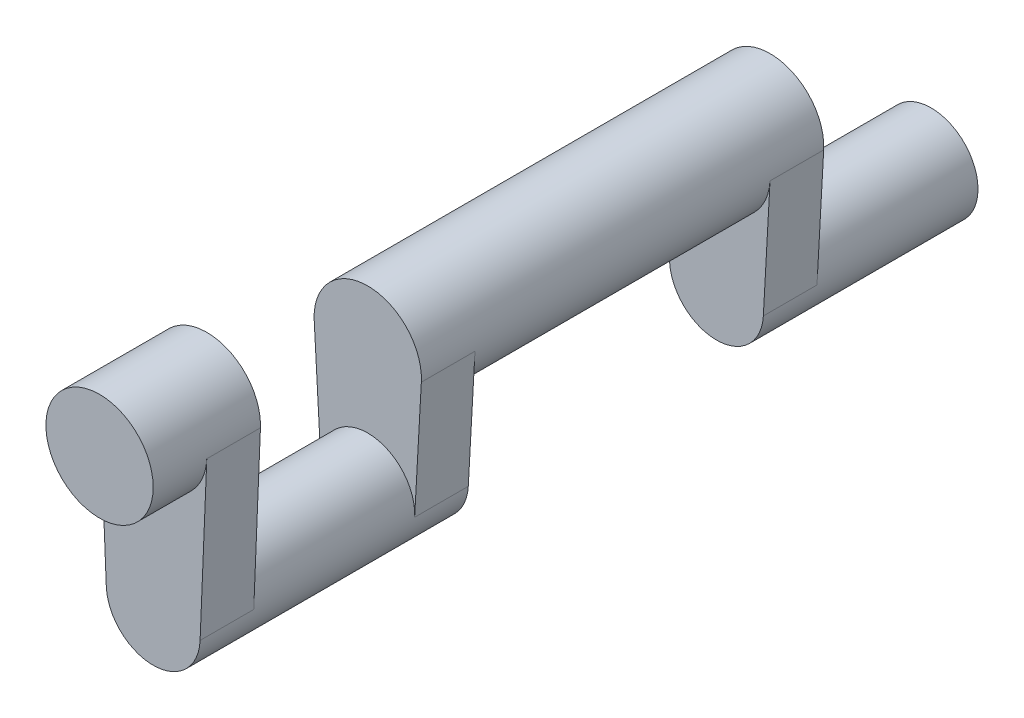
ISO-10303-21;
HEADER;
FILE_DESCRIPTION(('STEP AP214'),'2;1');
FILE_NAME('part.step','',(''),(''),'','','');
FILE_SCHEMA(('AUTOMOTIVE_DESIGN { 1 0 10303 214 1 1 1 1 }'));
ENDSEC;
DATA;
#1=APPLICATION_CONTEXT('core data for automotive mechanical design processes');
#2=APPLICATION_PROTOCOL_DEFINITION('international standard','automotive_design',2000,#1);
#3=PRODUCT_CONTEXT('',#1,'mechanical');
#4=PRODUCT('Part','Part','',(#3));
#5=PRODUCT_RELATED_PRODUCT_CATEGORY('part','',(#4));
#6=PRODUCT_DEFINITION_FORMATION('','',#4);
#7=PRODUCT_DEFINITION_CONTEXT('part definition',#1,'design');
#8=PRODUCT_DEFINITION('design','',#6,#7);
#9=PRODUCT_DEFINITION_SHAPE('','',#8);
#10=(LENGTH_UNIT() NAMED_UNIT(*) SI_UNIT(.MILLI.,.METRE.));
#11=(NAMED_UNIT(*) PLANE_ANGLE_UNIT() SI_UNIT($,.RADIAN.));
#12=(NAMED_UNIT(*) SI_UNIT($,.STERADIAN.) SOLID_ANGLE_UNIT());
#13=UNCERTAINTY_MEASURE_WITH_UNIT(LENGTH_MEASURE(1.E-05),#10,'distance_accuracy_value','');
#14=(GEOMETRIC_REPRESENTATION_CONTEXT(3) GLOBAL_UNCERTAINTY_ASSIGNED_CONTEXT((#13)) GLOBAL_UNIT_ASSIGNED_CONTEXT((#10,
#11,#12)) REPRESENTATION_CONTEXT('',''));
#15=CARTESIAN_POINT('',(0.,0.,0.));
#16=DIRECTION('',(0.,0.,1.));
#17=DIRECTION('',(1.,0.,0.));
#18=AXIS2_PLACEMENT_3D('',#15,#16,#17);
#19=CARTESIAN_POINT('',(0.,-19.0500000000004,-317.5));
#20=DIRECTION('',(0.,0.,-1.));
#21=DIRECTION('',(-1.,0.,0.));
#22=AXIS2_PLACEMENT_3D('',#19,#20,#21);
#23=PLANE('',#22);
#24=DIRECTION('',(-0.0555555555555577,-0.998455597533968,0.));
#25=VECTOR('',#24,1.);
#26=CARTESIAN_POINT('',(22.1906756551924,-77.4347222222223,-317.5));
#27=LINE('',#26,#25);
#28=CARTESIAN_POINT('',(25.3607721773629,-20.4611111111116,-317.5));
#29=VERTEX_POINT('',#28);
#30=CARTESIAN_POINT('',(22.1906756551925,-77.4347222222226,-317.5));
#31=VERTEX_POINT('',#30);
#32=EDGE_CURVE('E137',#29,#31,#27,.T.);
#33=ORIENTED_EDGE('',*,*,#32,.T.);
#34=CARTESIAN_POINT('',(0.,-76.2000000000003,-317.5));
#35=DIRECTION('',(0.,0.,1.));
#36=DIRECTION('',(1.,0.,0.));
#37=AXIS2_PLACEMENT_3D('',#34,#35,#36);
#38=CIRCLE('',#37,22.225);
#39=CARTESIAN_POINT('',(-22.1906756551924,-77.4347222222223,-317.5));
#40=VERTEX_POINT('',#39);
#41=EDGE_CURVE('E11',#31,#40,#38,.T.);
#42=ORIENTED_EDGE('',*,*,#41,.T.);
#43=DIRECTION('',(-0.0555555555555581,0.998455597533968,0.));
#44=VECTOR('',#43,1.);
#45=CARTESIAN_POINT('',(-25.3607721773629,-20.4611111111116,-317.5));
#46=LINE('',#45,#44);
#47=CARTESIAN_POINT('',(-25.3607721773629,-20.4611111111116,-317.5));
#48=VERTEX_POINT('',#47);
#49=EDGE_CURVE('E51',#40,#48,#46,.T.);
#50=ORIENTED_EDGE('',*,*,#49,.T.);
#51=CARTESIAN_POINT('',(0.,-19.0500000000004,-317.5));
#52=DIRECTION('',(0.,0.,-1.));
#53=DIRECTION('',(-1.,0.,0.));
#54=AXIS2_PLACEMENT_3D('',#51,#52,#53);
#55=CIRCLE('',#54,25.4000000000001);
#56=EDGE_CURVE('E144',#48,#29,#55,.T.);
#57=ORIENTED_EDGE('',*,*,#56,.T.);
#58=EDGE_LOOP('',(#33,#42,#50,#57));
#59=FACE_BOUND('',#58,.T.);
#60=ADVANCED_FACE('F35',(#59),#23,.T.);
#61=CARTESIAN_POINT('',(0.,-76.2,-152.4));
#62=DIRECTION('',(0.,0.,-1.));
#63=DIRECTION('',(-1.,0.,0.));
#64=AXIS2_PLACEMENT_3D('',#61,#62,#63);
#65=PLANE('',#64);
#66=DIRECTION('',(-0.0555555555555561,0.998455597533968,0.));
#67=VECTOR('',#66,1.);
#68=CARTESIAN_POINT('',(-25.3607721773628,-20.4611111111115,-152.4));
#69=LINE('',#68,#67);
#70=CARTESIAN_POINT('',(-22.1906756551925,-77.4347222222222,-152.4));
#71=VERTEX_POINT('',#70);
#72=CARTESIAN_POINT('',(-25.3607721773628,-20.4611111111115,-152.4));
#73=VERTEX_POINT('',#72);
#74=EDGE_CURVE('E316',#71,#73,#69,.T.);
#75=ORIENTED_EDGE('',*,*,#74,.T.);
#76=CARTESIAN_POINT('',(0.,-19.0500000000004,-152.4));
#77=DIRECTION('',(0.,0.,-1.));
#78=DIRECTION('',(-1.,0.,0.));
#79=AXIS2_PLACEMENT_3D('',#76,#77,#78);
#80=CIRCLE('',#79,25.4000000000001);
#81=CARTESIAN_POINT('',(25.3607721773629,-20.4611111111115,-152.4));
#82=VERTEX_POINT('',#81);
#83=EDGE_CURVE('E161',#73,#82,#80,.F.);
#84=ORIENTED_EDGE('',*,*,#83,.T.);
#85=DIRECTION('',(-0.0555555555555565,-0.998455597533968,0.));
#86=VECTOR('',#85,1.);
#87=CARTESIAN_POINT('',(22.1906756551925,-77.4347222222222,-152.4));
#88=LINE('',#87,#86);
#89=CARTESIAN_POINT('',(22.1906756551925,-77.4347222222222,-152.4));
#90=VERTEX_POINT('',#89);
#91=EDGE_CURVE('E181',#82,#90,#88,.T.);
#92=ORIENTED_EDGE('',*,*,#91,.T.);
#93=CARTESIAN_POINT('',(0.,-76.2,-152.4));
#94=DIRECTION('',(0.,0.,-1.));
#95=DIRECTION('',(-1.,0.,0.));
#96=AXIS2_PLACEMENT_3D('',#93,#94,#95);
#97=CIRCLE('',#96,22.225);
#98=EDGE_CURVE('E187',#90,#71,#97,.T.);
#99=ORIENTED_EDGE('',*,*,#98,.T.);
#100=EDGE_LOOP('',(#75,#84,#92,#99));
#101=FACE_BOUND('',#100,.T.);
#102=ADVANCED_FACE('F277',(#101),#65,.T.);
#103=CARTESIAN_POINT('',(0.,0.,-25.4));
#104=DIRECTION('',(0.,0.,1.));
#105=DIRECTION('',(1.,0.,0.));
#106=AXIS2_PLACEMENT_3D('',#103,#104,#105);
#107=CYLINDRICAL_SURFACE('',#106,25.4);
#108=CARTESIAN_POINT('',(0.,0.,-25.4));
#109=DIRECTION('',(0.,0.,1.));
#110=DIRECTION('',(1.,0.,0.));
#111=AXIS2_PLACEMENT_3D('',#108,#109,#110);
#112=CIRCLE('',#111,25.4);
#113=CARTESIAN_POINT('',(-25.3779418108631,-1.05833333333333,-25.4));
#114=VERTEX_POINT('',#113);
#115=CARTESIAN_POINT('',(25.3779418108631,-1.05833333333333,-25.4));
#116=VERTEX_POINT('',#115);
#117=EDGE_CURVE('E207',#114,#116,#112,.T.);
#118=ORIENTED_EDGE('',*,*,#117,.T.);
#119=DIRECTION('',(0.,0.,1.));
#120=VECTOR('',#119,1.);
#121=CARTESIAN_POINT('',(25.3779418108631,-1.05833333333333,-50.8));
#122=LINE('',#121,#120);
#123=CARTESIAN_POINT('',(25.3779418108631,-1.05833333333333,-50.8));
#124=VERTEX_POINT('',#123);
#125=EDGE_CURVE('E217',#124,#116,#122,.T.);
#126=ORIENTED_EDGE('',*,*,#125,.F.);
#127=CARTESIAN_POINT('',(0.,0.,-50.8));
#128=DIRECTION('',(0.,0.,-1.));
#129=DIRECTION('',(-1.,0.,0.));
#130=AXIS2_PLACEMENT_3D('',#127,#128,#129);
#131=CIRCLE('',#130,25.4);
#132=CARTESIAN_POINT('',(-25.3779418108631,-1.05833333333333,-50.8));
#133=VERTEX_POINT('',#132);
#134=EDGE_CURVE('E220',#133,#124,#131,.T.);
#135=ORIENTED_EDGE('',*,*,#134,.F.);
#136=DIRECTION('',(0.,0.,1.));
#137=VECTOR('',#136,1.);
#138=CARTESIAN_POINT('',(-25.3779418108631,-1.05833333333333,-50.8));
#139=LINE('',#138,#137);
#140=EDGE_CURVE('E196',#133,#114,#139,.T.);
#141=ORIENTED_EDGE('',*,*,#140,.T.);
#142=EDGE_LOOP('',(#118,#126,#135,#141));
#143=FACE_BOUND('',#142,.T.);
#144=CARTESIAN_POINT('',(0.,0.,0.));
#145=DIRECTION('',(0.,0.,1.));
#146=DIRECTION('',(1.,0.,0.));
#147=AXIS2_PLACEMENT_3D('',#144,#145,#146);
#148=CIRCLE('',#147,25.4);
#149=CARTESIAN_POINT('',(25.4,0.,0.));
#150=VERTEX_POINT('',#149);
#151=EDGE_CURVE('E234',#150,#150,#148,.T.);
#152=ORIENTED_EDGE('',*,*,#151,.F.);
#153=EDGE_LOOP('',(#152));
#154=FACE_BOUND('',#153,.T.);
#155=ADVANCED_FACE('F37',(#143,#154),#107,.T.);
#156=CARTESIAN_POINT('',(0.,0.,0.));
#157=DIRECTION('',(0.,0.,1.));
#158=DIRECTION('',(1.,0.,0.));
#159=AXIS2_PLACEMENT_3D('',#156,#157,#158);
#160=PLANE('',#159);
#161=ORIENTED_EDGE('',*,*,#151,.T.);
#162=EDGE_LOOP('',(#161));
#163=FACE_BOUND('',#162,.T.);
#164=ADVANCED_FACE('F432',(#163),#160,.T.);
#165=CARTESIAN_POINT('',(25.3779418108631,-1.05833333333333,-50.8));
#166=DIRECTION('',(-0.999131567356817,0.0416666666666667,0.));
#167=DIRECTION('',(-0.0416666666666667,-0.999131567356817,0.));
#168=AXIS2_PLACEMENT_3D('',#165,#166,#167);
#169=PLANE('',#168);
#170=DIRECTION('',(-0.0416666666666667,-0.999131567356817,0.));
#171=VECTOR('',#170,1.);
#172=CARTESIAN_POINT('',(25.3779418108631,-1.05833333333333,-25.4));
#173=LINE('',#172,#171);
#174=CARTESIAN_POINT('',(22.2056990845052,-77.1260416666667,-25.4));
#175=VERTEX_POINT('',#174);
#176=EDGE_CURVE('E189',#116,#175,#173,.T.);
#177=ORIENTED_EDGE('',*,*,#176,.T.);
#178=DIRECTION('',(0.,0.,1.));
#179=VECTOR('',#178,1.);
#180=CARTESIAN_POINT('',(22.2056990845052,-77.1260416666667,-50.8));
#181=LINE('',#180,#179);
#182=CARTESIAN_POINT('',(22.2056990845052,-77.1260416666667,-50.8));
#183=VERTEX_POINT('',#182);
#184=EDGE_CURVE('E203',#183,#175,#181,.T.);
#185=ORIENTED_EDGE('',*,*,#184,.F.);
#186=DIRECTION('',(-0.0416666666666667,-0.999131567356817,0.));
#187=VECTOR('',#186,1.);
#188=CARTESIAN_POINT('',(25.3779418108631,-1.05833333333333,-50.8));
#189=LINE('',#188,#187);
#190=EDGE_CURVE('E197',#124,#183,#189,.T.);
#191=ORIENTED_EDGE('',*,*,#190,.F.);
#192=ORIENTED_EDGE('',*,*,#125,.T.);
#193=EDGE_LOOP('',(#177,#185,#191,#192));
#194=FACE_BOUND('',#193,.T.);
#195=ADVANCED_FACE('F250',(#194),#169,.F.);
#196=CARTESIAN_POINT('',(0.,-76.2,-50.8));
#197=DIRECTION('',(0.,0.,1.));
#198=DIRECTION('',(1.,0.,0.));
#199=AXIS2_PLACEMENT_3D('',#196,#197,#198);
#200=CYLINDRICAL_SURFACE('',#199,22.225);
#201=CARTESIAN_POINT('',(0.,-76.2,-25.4));
#202=DIRECTION('',(0.,0.,-1.));
#203=DIRECTION('',(-1.,0.,0.));
#204=AXIS2_PLACEMENT_3D('',#201,#202,#203);
#205=CIRCLE('',#204,22.225);
#206=CARTESIAN_POINT('',(-22.2056990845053,-77.1260416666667,-25.4));
#207=VERTEX_POINT('',#206);
#208=EDGE_CURVE('E228',#175,#207,#205,.T.);
#209=ORIENTED_EDGE('',*,*,#208,.T.);
#210=DIRECTION('',(0.,0.,1.));
#211=VECTOR('',#210,1.);
#212=CARTESIAN_POINT('',(-22.2056990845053,-77.1260416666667,-50.8));
#213=LINE('',#212,#211);
#214=CARTESIAN_POINT('',(-22.2056990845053,-77.1260416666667,-50.8));
#215=VERTEX_POINT('',#214);
#216=EDGE_CURVE('E200',#215,#207,#213,.T.);
#217=ORIENTED_EDGE('',*,*,#216,.F.);
#218=CARTESIAN_POINT('',(0.,-76.2,-50.8));
#219=DIRECTION('',(0.,0.,-1.));
#220=DIRECTION('',(-1.,0.,0.));
#221=AXIS2_PLACEMENT_3D('',#218,#219,#220);
#222=CIRCLE('',#221,22.225);
#223=EDGE_CURVE('E164',#215,#183,#222,.T.);
#224=ORIENTED_EDGE('',*,*,#223,.T.);
#225=ORIENTED_EDGE('',*,*,#184,.T.);
#226=EDGE_LOOP('',(#209,#217,#224,#225));
#227=FACE_BOUND('',#226,.T.);
#228=CARTESIAN_POINT('',(0.,-76.2,-127.));
#229=DIRECTION('',(0.,0.,-1.));
#230=DIRECTION('',(-1.,0.,0.));
#231=AXIS2_PLACEMENT_3D('',#228,#229,#230);
#232=CIRCLE('',#231,22.225);
#233=CARTESIAN_POINT('',(-22.1906756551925,-77.4347222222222,-127.));
#234=VERTEX_POINT('',#233);
#235=CARTESIAN_POINT('',(22.1906756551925,-77.4347222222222,-127.));
#236=VERTEX_POINT('',#235);
#237=EDGE_CURVE('E59',#234,#236,#232,.T.);
#238=ORIENTED_EDGE('',*,*,#237,.F.);
#239=DIRECTION('',(0.,0.,1.));
#240=VECTOR('',#239,1.);
#241=CARTESIAN_POINT('',(-22.1906756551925,-77.4347222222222,-152.4));
#242=LINE('',#241,#240);
#243=EDGE_CURVE('E167',#71,#234,#242,.T.);
#244=ORIENTED_EDGE('',*,*,#243,.F.);
#245=ORIENTED_EDGE('',*,*,#98,.F.);
#246=DIRECTION('',(0.,0.,1.));
#247=VECTOR('',#246,1.);
#248=CARTESIAN_POINT('',(22.1906756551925,-77.4347222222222,-152.4));
#249=LINE('',#248,#247);
#250=EDGE_CURVE('E178',#90,#236,#249,.T.);
#251=ORIENTED_EDGE('',*,*,#250,.T.);
#252=EDGE_LOOP('',(#238,#244,#245,#251));
#253=FACE_BOUND('',#252,.T.);
#254=ADVANCED_FACE('F261',(#227,#253),#200,.T.);
#255=CARTESIAN_POINT('',(-22.2056990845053,-77.1260416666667,-50.8));
#256=DIRECTION('',(0.999131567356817,0.0416666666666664,0.));
#257=DIRECTION('',(-0.0416666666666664,0.999131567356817,0.));
#258=AXIS2_PLACEMENT_3D('',#255,#256,#257);
#259=PLANE('',#258);
#260=DIRECTION('',(-0.0416666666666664,0.999131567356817,0.));
#261=VECTOR('',#260,1.);
#262=CARTESIAN_POINT('',(-22.2056990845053,-77.1260416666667,-25.4));
#263=LINE('',#262,#261);
#264=EDGE_CURVE('E223',#207,#114,#263,.T.);
#265=ORIENTED_EDGE('',*,*,#264,.T.);
#266=ORIENTED_EDGE('',*,*,#140,.F.);
#267=DIRECTION('',(-0.0416666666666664,0.999131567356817,0.));
#268=VECTOR('',#267,1.);
#269=CARTESIAN_POINT('',(-22.2056990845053,-77.1260416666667,-50.8));
#270=LINE('',#269,#268);
#271=EDGE_CURVE('E194',#215,#133,#270,.T.);
#272=ORIENTED_EDGE('',*,*,#271,.F.);
#273=ORIENTED_EDGE('',*,*,#216,.T.);
#274=EDGE_LOOP('',(#265,#266,#272,#273));
#275=FACE_BOUND('',#274,.T.);
#276=ADVANCED_FACE('F264',(#275),#259,.F.);
#277=CARTESIAN_POINT('',(0.,0.,-50.8));
#278=DIRECTION('',(0.,0.,-1.));
#279=DIRECTION('',(-1.,0.,0.));
#280=AXIS2_PLACEMENT_3D('',#277,#278,#279);
#281=PLANE('',#280);
#282=ORIENTED_EDGE('',*,*,#223,.F.);
#283=ORIENTED_EDGE('',*,*,#271,.T.);
#284=ORIENTED_EDGE('',*,*,#134,.T.);
#285=ORIENTED_EDGE('',*,*,#190,.T.);
#286=EDGE_LOOP('',(#282,#283,#284,#285));
#287=FACE_BOUND('',#286,.T.);
#288=ADVANCED_FACE('F265',(#287),#281,.T.);
#289=CARTESIAN_POINT('',(0.,0.,-25.4));
#290=DIRECTION('',(0.,0.,-1.));
#291=DIRECTION('',(-1.,0.,0.));
#292=AXIS2_PLACEMENT_3D('',#289,#290,#291);
#293=PLANE('',#292);
#294=ORIENTED_EDGE('',*,*,#117,.F.);
#295=ORIENTED_EDGE('',*,*,#264,.F.);
#296=ORIENTED_EDGE('',*,*,#208,.F.);
#297=ORIENTED_EDGE('',*,*,#176,.F.);
#298=EDGE_LOOP('',(#294,#295,#296,#297));
#299=FACE_BOUND('',#298,.T.);
#300=ADVANCED_FACE('F257',(#299),#293,.F.);
#301=CARTESIAN_POINT('',(0.,-76.2,-127.));
#302=DIRECTION('',(0.,0.,-1.));
#303=DIRECTION('',(-1.,0.,0.));
#304=AXIS2_PLACEMENT_3D('',#301,#302,#303);
#305=PLANE('',#304);
#306=CARTESIAN_POINT('',(0.,-19.0500000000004,-127.));
#307=DIRECTION('',(0.,0.,-1.));
#308=DIRECTION('',(1.,0.,0.));
#309=AXIS2_PLACEMENT_3D('',#306,#307,#308);
#310=CIRCLE('',#309,25.4);
#311=CARTESIAN_POINT('',(-25.3607721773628,-20.4611111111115,-127.));
#312=VERTEX_POINT('',#311);
#313=CARTESIAN_POINT('',(25.3607721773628,-20.4611111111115,-127.));
#314=VERTEX_POINT('',#313);
#315=EDGE_CURVE('E175',#312,#314,#310,.T.);
#316=ORIENTED_EDGE('',*,*,#315,.F.);
#317=DIRECTION('',(-0.0555555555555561,0.998455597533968,0.));
#318=VECTOR('',#317,1.);
#319=CARTESIAN_POINT('',(-25.3607721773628,-20.4611111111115,-127.));
#320=LINE('',#319,#318);
#321=EDGE_CURVE('E173',#234,#312,#320,.T.);
#322=ORIENTED_EDGE('',*,*,#321,.F.);
#323=ORIENTED_EDGE('',*,*,#237,.T.);
#324=DIRECTION('',(-0.0555555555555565,-0.998455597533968,0.));
#325=VECTOR('',#324,1.);
#326=CARTESIAN_POINT('',(22.1906756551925,-77.4347222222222,-127.));
#327=LINE('',#326,#325);
#328=EDGE_CURVE('E184',#314,#236,#327,.T.);
#329=ORIENTED_EDGE('',*,*,#328,.F.);
#330=EDGE_LOOP('',(#316,#322,#323,#329));
#331=FACE_BOUND('',#330,.T.);
#332=ADVANCED_FACE('F272',(#331),#305,.F.);
#333=CARTESIAN_POINT('',(-25.3607721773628,-20.4611111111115,-152.4));
#334=DIRECTION('',(0.998455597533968,0.055555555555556,0.));
#335=DIRECTION('',(-0.0555555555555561,0.998455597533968,0.));
#336=AXIS2_PLACEMENT_3D('',#333,#334,#335);
#337=PLANE('',#336);
#338=ORIENTED_EDGE('',*,*,#321,.T.);
#339=DIRECTION('',(0.,0.,1.));
#340=VECTOR('',#339,1.);
#341=CARTESIAN_POINT('',(-25.3607721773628,-20.4611111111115,-152.4));
#342=LINE('',#341,#340);
#343=EDGE_CURVE('E170',#73,#312,#342,.T.);
#344=ORIENTED_EDGE('',*,*,#343,.F.);
#345=ORIENTED_EDGE('',*,*,#74,.F.);
#346=ORIENTED_EDGE('',*,*,#243,.T.);
#347=EDGE_LOOP('',(#338,#344,#345,#346));
#348=FACE_BOUND('',#347,.T.);
#349=ADVANCED_FACE('F289',(#348),#337,.F.);
#350=CARTESIAN_POINT('',(0.,-19.0500000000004,-152.4));
#351=DIRECTION('',(0.,0.,1.));
#352=DIRECTION('',(1.,0.,0.));
#353=AXIS2_PLACEMENT_3D('',#350,#351,#352);
#354=CYLINDRICAL_SURFACE('',#353,25.4);
#355=ORIENTED_EDGE('',*,*,#56,.F.);
#356=DIRECTION('',(0.,0.,-1.));
#357=VECTOR('',#356,1.);
#358=CARTESIAN_POINT('',(-25.3607721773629,-20.4611111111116,-292.1));
#359=LINE('',#358,#357);
#360=CARTESIAN_POINT('',(-25.3607721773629,-20.4611111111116,-292.1));
#361=VERTEX_POINT('',#360);
#362=EDGE_CURVE('E156',#361,#48,#359,.T.);
#363=ORIENTED_EDGE('',*,*,#362,.F.);
#364=CARTESIAN_POINT('',(0.,-19.0500000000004,-292.1));
#365=DIRECTION('',(0.,0.,-1.));
#366=DIRECTION('',(-1.,0.,0.));
#367=AXIS2_PLACEMENT_3D('',#364,#365,#366);
#368=CIRCLE('',#367,25.4);
#369=CARTESIAN_POINT('',(25.3607721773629,-20.4611111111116,-292.1));
#370=VERTEX_POINT('',#369);
#371=EDGE_CURVE('E44',#370,#361,#368,.T.);
#372=ORIENTED_EDGE('',*,*,#371,.F.);
#373=DIRECTION('',(0.,0.,-1.));
#374=VECTOR('',#373,1.);
#375=CARTESIAN_POINT('',(25.3607721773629,-20.4611111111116,-292.1));
#376=LINE('',#375,#374);
#377=EDGE_CURVE('E141',#370,#29,#376,.T.);
#378=ORIENTED_EDGE('',*,*,#377,.T.);
#379=EDGE_LOOP('',(#355,#363,#372,#378));
#380=FACE_BOUND('',#379,.T.);
#381=ORIENTED_EDGE('',*,*,#315,.T.);
#382=DIRECTION('',(0.,0.,1.));
#383=VECTOR('',#382,1.);
#384=CARTESIAN_POINT('',(25.3607721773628,-20.4611111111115,-152.4));
#385=LINE('',#384,#383);
#386=EDGE_CURVE('E180',#82,#314,#385,.T.);
#387=ORIENTED_EDGE('',*,*,#386,.F.);
#388=ORIENTED_EDGE('',*,*,#83,.F.);
#389=ORIENTED_EDGE('',*,*,#343,.T.);
#390=EDGE_LOOP('',(#381,#387,#388,#389));
#391=FACE_BOUND('',#390,.T.);
#392=ADVANCED_FACE('F295',(#380,#391),#354,.T.);
#393=CARTESIAN_POINT('',(22.1906756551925,-77.4347222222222,-152.4));
#394=DIRECTION('',(-0.998455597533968,0.0555555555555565,0.));
#395=DIRECTION('',(-0.0555555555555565,-0.998455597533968,0.));
#396=AXIS2_PLACEMENT_3D('',#393,#394,#395);
#397=PLANE('',#396);
#398=ORIENTED_EDGE('',*,*,#328,.T.);
#399=ORIENTED_EDGE('',*,*,#250,.F.);
#400=ORIENTED_EDGE('',*,*,#91,.F.);
#401=ORIENTED_EDGE('',*,*,#386,.T.);
#402=EDGE_LOOP('',(#398,#399,#400,#401));
#403=FACE_BOUND('',#402,.T.);
#404=ADVANCED_FACE('F291',(#403),#397,.F.);
#405=CARTESIAN_POINT('',(0.,-19.0500000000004,-292.1));
#406=DIRECTION('',(0.,0.,-1.));
#407=DIRECTION('',(-1.,0.,0.));
#408=AXIS2_PLACEMENT_3D('',#405,#406,#407);
#409=PLANE('',#408);
#410=DIRECTION('',(-0.0555555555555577,-0.998455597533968,0.));
#411=VECTOR('',#410,1.);
#412=CARTESIAN_POINT('',(22.1906756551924,-77.4347222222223,-292.1));
#413=LINE('',#412,#411);
#414=CARTESIAN_POINT('',(22.1906756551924,-77.4347222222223,-292.1));
#415=VERTEX_POINT('',#414);
#416=EDGE_CURVE('E140',#370,#415,#413,.T.);
#417=ORIENTED_EDGE('',*,*,#416,.F.);
#418=ORIENTED_EDGE('',*,*,#371,.T.);
#419=DIRECTION('',(-0.0555555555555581,0.998455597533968,0.));
#420=VECTOR('',#419,1.);
#421=CARTESIAN_POINT('',(-25.3607721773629,-20.4611111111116,-292.1));
#422=LINE('',#421,#420);
#423=CARTESIAN_POINT('',(-22.1906756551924,-77.4347222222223,-292.1));
#424=VERTEX_POINT('',#423);
#425=EDGE_CURVE('E322',#424,#361,#422,.T.);
#426=ORIENTED_EDGE('',*,*,#425,.F.);
#427=CARTESIAN_POINT('',(0.,-76.2000000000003,-292.1));
#428=DIRECTION('',(0.,0.,-1.));
#429=DIRECTION('',(1.,0.,0.));
#430=AXIS2_PLACEMENT_3D('',#427,#428,#429);
#431=CIRCLE('',#430,22.225);
#432=EDGE_CURVE('E326',#415,#424,#431,.T.);
#433=ORIENTED_EDGE('',*,*,#432,.F.);
#434=EDGE_LOOP('',(#417,#418,#426,#433));
#435=FACE_BOUND('',#434,.T.);
#436=ADVANCED_FACE('F294',(#435),#409,.F.);
#437=CARTESIAN_POINT('',(-25.3607721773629,-20.4611111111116,-292.1));
#438=DIRECTION('',(-0.998455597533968,-0.0555555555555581,0.));
#439=DIRECTION('',(0.0555555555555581,-0.998455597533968,0.));
#440=AXIS2_PLACEMENT_3D('',#437,#438,#439);
#441=PLANE('',#440);
#442=ORIENTED_EDGE('',*,*,#49,.F.);
#443=DIRECTION('',(0.,0.,-1.));
#444=VECTOR('',#443,1.);
#445=CARTESIAN_POINT('',(-22.1906756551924,-77.4347222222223,-292.1));
#446=LINE('',#445,#444);
#447=EDGE_CURVE('E132',#424,#40,#446,.T.);
#448=ORIENTED_EDGE('',*,*,#447,.F.);
#449=ORIENTED_EDGE('',*,*,#425,.T.);
#450=ORIENTED_EDGE('',*,*,#362,.T.);
#451=EDGE_LOOP('',(#442,#448,#449,#450));
#452=FACE_BOUND('',#451,.T.);
#453=ADVANCED_FACE('F333',(#452),#441,.T.);
#454=CARTESIAN_POINT('',(0.,-76.2000000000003,-292.1));
#455=DIRECTION('',(0.,0.,-1.));
#456=DIRECTION('',(-1.,0.,0.));
#457=AXIS2_PLACEMENT_3D('',#454,#455,#456);
#458=CYLINDRICAL_SURFACE('',#457,22.225);
#459=ORIENTED_EDGE('',*,*,#447,.T.);
#460=ORIENTED_EDGE('',*,*,#41,.F.);
#461=DIRECTION('',(0.,0.,-1.));
#462=VECTOR('',#461,1.);
#463=CARTESIAN_POINT('',(22.1906756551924,-77.4347222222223,-292.1));
#464=LINE('',#463,#462);
#465=EDGE_CURVE('E130',#415,#31,#464,.T.);
#466=ORIENTED_EDGE('',*,*,#465,.F.);
#467=ORIENTED_EDGE('',*,*,#432,.T.);
#468=EDGE_LOOP('',(#459,#460,#466,#467));
#469=FACE_BOUND('',#468,.T.);
#470=CARTESIAN_POINT('',(0.,-76.2000000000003,-393.7));
#471=DIRECTION('',(0.,0.,1.));
#472=DIRECTION('',(1.,0.,0.));
#473=AXIS2_PLACEMENT_3D('',#470,#471,#472);
#474=CIRCLE('',#473,22.225);
#475=CARTESIAN_POINT('',(22.225,-76.2000000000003,-393.7));
#476=VERTEX_POINT('',#475);
#477=EDGE_CURVE('E145',#476,#476,#474,.T.);
#478=ORIENTED_EDGE('',*,*,#477,.T.);
#479=EDGE_LOOP('',(#478));
#480=FACE_BOUND('',#479,.T.);
#481=ADVANCED_FACE('F127',(#469,#480),#458,.T.);
#482=CARTESIAN_POINT('',(22.1906756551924,-77.4347222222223,-292.1));
#483=DIRECTION('',(0.998455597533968,-0.0555555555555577,0.));
#484=DIRECTION('',(0.0555555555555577,0.998455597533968,0.));
#485=AXIS2_PLACEMENT_3D('',#482,#483,#484);
#486=PLANE('',#485);
#487=ORIENTED_EDGE('',*,*,#32,.F.);
#488=ORIENTED_EDGE('',*,*,#377,.F.);
#489=ORIENTED_EDGE('',*,*,#416,.T.);
#490=ORIENTED_EDGE('',*,*,#465,.T.);
#491=EDGE_LOOP('',(#487,#488,#489,#490));
#492=FACE_BOUND('',#491,.T.);
#493=ADVANCED_FACE('F136',(#492),#486,.T.);
#494=CARTESIAN_POINT('',(0.,-76.2000000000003,-393.7));
#495=DIRECTION('',(0.,0.,1.));
#496=DIRECTION('',(1.,0.,0.));
#497=AXIS2_PLACEMENT_3D('',#494,#495,#496);
#498=PLANE('',#497);
#499=ORIENTED_EDGE('',*,*,#477,.F.);
#500=EDGE_LOOP('',(#499));
#501=FACE_BOUND('',#500,.T.);
#502=ADVANCED_FACE('F342',(#501),#498,.F.);
#503=CLOSED_SHELL('',(#60,#102,#155,#164,#195,#254,#276,#288,#300,#332,#349,#392,#404,#436,#453,
#481,#493,#502));
#504=MANIFOLD_SOLID_BREP('B2',#503);
#505=ADVANCED_BREP_SHAPE_REPRESENTATION('',(#18,#504),#14);
#506=SHAPE_DEFINITION_REPRESENTATION(#9,#505);
ENDSEC;
END-ISO-10303-21;
